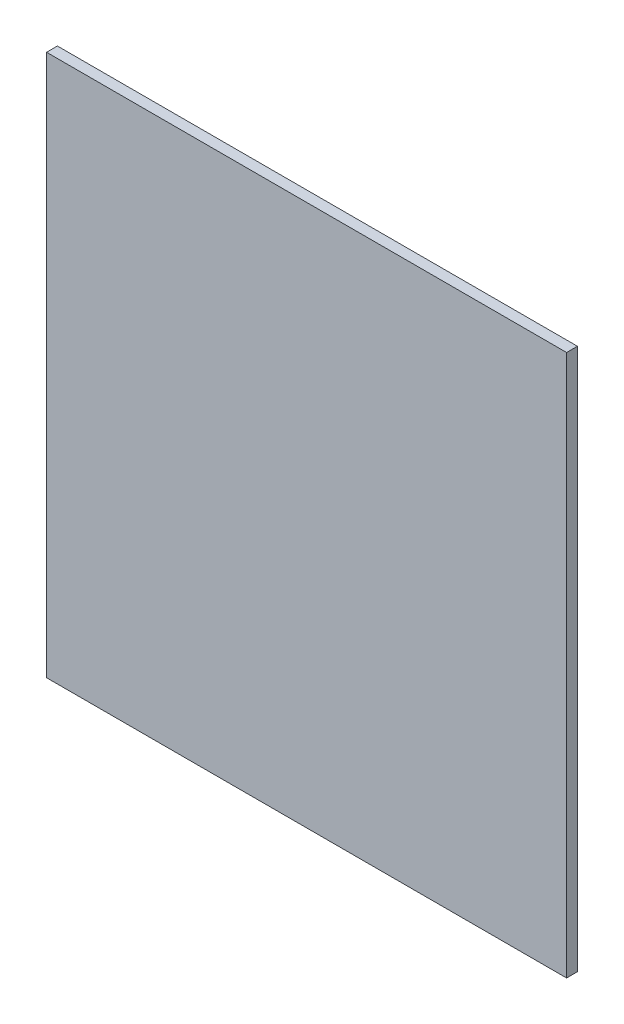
ISO-10303-21;
HEADER;
FILE_DESCRIPTION(('STEP AP214'),'2;1');
FILE_NAME('part.step','',(''),(''),'','','');
FILE_SCHEMA(('AUTOMOTIVE_DESIGN { 1 0 10303 214 1 1 1 1 }'));
ENDSEC;
DATA;
#1=APPLICATION_CONTEXT('core data for automotive mechanical design processes');
#2=APPLICATION_PROTOCOL_DEFINITION('international standard','automotive_design',2000,#1);
#3=PRODUCT_CONTEXT('',#1,'mechanical');
#4=PRODUCT('Part','Part','',(#3));
#5=PRODUCT_RELATED_PRODUCT_CATEGORY('part','',(#4));
#6=PRODUCT_DEFINITION_FORMATION('','',#4);
#7=PRODUCT_DEFINITION_CONTEXT('part definition',#1,'design');
#8=PRODUCT_DEFINITION('design','',#6,#7);
#9=PRODUCT_DEFINITION_SHAPE('','',#8);
#10=(LENGTH_UNIT() NAMED_UNIT(*) SI_UNIT(.MILLI.,.METRE.));
#11=(NAMED_UNIT(*) PLANE_ANGLE_UNIT() SI_UNIT($,.RADIAN.));
#12=(NAMED_UNIT(*) SI_UNIT($,.STERADIAN.) SOLID_ANGLE_UNIT());
#13=UNCERTAINTY_MEASURE_WITH_UNIT(LENGTH_MEASURE(1.E-05),#10,'distance_accuracy_value','');
#14=(GEOMETRIC_REPRESENTATION_CONTEXT(3) GLOBAL_UNCERTAINTY_ASSIGNED_CONTEXT((#13)) GLOBAL_UNIT_ASSIGNED_CONTEXT((#10,
#11,#12)) REPRESENTATION_CONTEXT('',''));
#15=CARTESIAN_POINT('',(0.,0.,0.));
#16=DIRECTION('',(0.,0.,1.));
#17=DIRECTION('',(1.,0.,0.));
#18=AXIS2_PLACEMENT_3D('',#15,#16,#17);
#19=CARTESIAN_POINT('',(304.8,-158.75,-158.75));
#20=DIRECTION('',(0.,1.,0.));
#21=DIRECTION('',(0.,0.,1.));
#22=AXIS2_PLACEMENT_3D('',#19,#20,#21);
#23=PLANE('',#22);
#24=DIRECTION('',(0.,0.,-1.));
#25=VECTOR('',#24,1.);
#26=CARTESIAN_POINT('',(0.,-158.75,-158.75));
#27=LINE('',#26,#25);
#28=CARTESIAN_POINT('',(0.,-158.75,-152.4));
#29=VERTEX_POINT('',#28);
#30=CARTESIAN_POINT('',(0.,-158.75,-158.75));
#31=VERTEX_POINT('',#30);
#32=EDGE_CURVE('E117',#29,#31,#27,.T.);
#33=ORIENTED_EDGE('',*,*,#32,.T.);
#34=DIRECTION('',(-1.,0.,0.));
#35=VECTOR('',#34,1.);
#36=CARTESIAN_POINT('',(304.8,-158.75,-158.75));
#37=LINE('',#36,#35);
#38=CARTESIAN_POINT('',(304.8,-158.75,-158.75));
#39=VERTEX_POINT('',#38);
#40=EDGE_CURVE('E11',#39,#31,#37,.T.);
#41=ORIENTED_EDGE('',*,*,#40,.F.);
#42=DIRECTION('',(0.,0.,-1.));
#43=VECTOR('',#42,1.);
#44=CARTESIAN_POINT('',(304.8,-158.75,-158.75));
#45=LINE('',#44,#43);
#46=CARTESIAN_POINT('',(304.8,-158.75,-152.4));
#47=VERTEX_POINT('',#46);
#48=EDGE_CURVE('E98',#47,#39,#45,.T.);
#49=ORIENTED_EDGE('',*,*,#48,.F.);
#50=DIRECTION('',(-1.,0.,0.));
#51=VECTOR('',#50,1.);
#52=CARTESIAN_POINT('',(304.8,-158.75,-152.4));
#53=LINE('',#52,#51);
#54=EDGE_CURVE('E115',#47,#29,#53,.T.);
#55=ORIENTED_EDGE('',*,*,#54,.T.);
#56=EDGE_LOOP('',(#33,#41,#49,#55));
#57=FACE_BOUND('',#56,.T.);
#58=ADVANCED_FACE('F50',(#57),#23,.F.);
#59=CARTESIAN_POINT('',(304.8,-158.75,-158.75));
#60=DIRECTION('',(0.,0.,1.));
#61=DIRECTION('',(1.,0.,0.));
#62=AXIS2_PLACEMENT_3D('',#59,#60,#61);
#63=PLANE('',#62);
#64=DIRECTION('',(0.,1.,0.));
#65=VECTOR('',#64,1.);
#66=CARTESIAN_POINT('',(0.,-158.75,-158.75));
#67=LINE('',#66,#65);
#68=CARTESIAN_POINT('',(0.,158.75,-158.75));
#69=VERTEX_POINT('',#68);
#70=EDGE_CURVE('E101',#31,#69,#67,.T.);
#71=ORIENTED_EDGE('',*,*,#70,.T.);
#72=DIRECTION('',(-1.,0.,0.));
#73=VECTOR('',#72,1.);
#74=CARTESIAN_POINT('',(304.8,158.75,-158.75));
#75=LINE('',#74,#73);
#76=CARTESIAN_POINT('',(304.8,158.75,-158.75));
#77=VERTEX_POINT('',#76);
#78=EDGE_CURVE('E57',#77,#69,#75,.T.);
#79=ORIENTED_EDGE('',*,*,#78,.F.);
#80=DIRECTION('',(0.,1.,0.));
#81=VECTOR('',#80,1.);
#82=CARTESIAN_POINT('',(304.8,-158.75,-158.75));
#83=LINE('',#82,#81);
#84=EDGE_CURVE('E92',#39,#77,#83,.T.);
#85=ORIENTED_EDGE('',*,*,#84,.F.);
#86=ORIENTED_EDGE('',*,*,#40,.T.);
#87=EDGE_LOOP('',(#71,#79,#85,#86));
#88=FACE_BOUND('',#87,.T.);
#89=ADVANCED_FACE('F104',(#88),#63,.F.);
#90=CARTESIAN_POINT('',(304.8,158.75,-158.75));
#91=DIRECTION('',(0.,-1.,0.));
#92=DIRECTION('',(0.,0.,-1.));
#93=AXIS2_PLACEMENT_3D('',#90,#91,#92);
#94=PLANE('',#93);
#95=DIRECTION('',(0.,0.,1.));
#96=VECTOR('',#95,1.);
#97=CARTESIAN_POINT('',(0.,158.75,-158.75));
#98=LINE('',#97,#96);
#99=CARTESIAN_POINT('',(0.,158.75,-152.4));
#100=VERTEX_POINT('',#99);
#101=EDGE_CURVE('E83',#69,#100,#98,.T.);
#102=ORIENTED_EDGE('',*,*,#101,.T.);
#103=DIRECTION('',(-1.,0.,0.));
#104=VECTOR('',#103,1.);
#105=CARTESIAN_POINT('',(304.8,158.75,-152.4));
#106=LINE('',#105,#104);
#107=CARTESIAN_POINT('',(304.8,158.75,-152.4));
#108=VERTEX_POINT('',#107);
#109=EDGE_CURVE('E108',#108,#100,#106,.T.);
#110=ORIENTED_EDGE('',*,*,#109,.F.);
#111=DIRECTION('',(0.,0.,1.));
#112=VECTOR('',#111,1.);
#113=CARTESIAN_POINT('',(304.8,158.75,-158.75));
#114=LINE('',#113,#112);
#115=EDGE_CURVE('E100',#77,#108,#114,.T.);
#116=ORIENTED_EDGE('',*,*,#115,.F.);
#117=ORIENTED_EDGE('',*,*,#78,.T.);
#118=EDGE_LOOP('',(#102,#110,#116,#117));
#119=FACE_BOUND('',#118,.T.);
#120=ADVANCED_FACE('F110',(#119),#94,.F.);
#121=CARTESIAN_POINT('',(304.8,-158.75,-152.4));
#122=DIRECTION('',(0.,0.,-1.));
#123=DIRECTION('',(-1.,0.,0.));
#124=AXIS2_PLACEMENT_3D('',#121,#122,#123);
#125=PLANE('',#124);
#126=DIRECTION('',(0.,-1.,0.));
#127=VECTOR('',#126,1.);
#128=CARTESIAN_POINT('',(0.,-158.75,-152.4));
#129=LINE('',#128,#127);
#130=EDGE_CURVE('E90',#100,#29,#129,.T.);
#131=ORIENTED_EDGE('',*,*,#130,.T.);
#132=ORIENTED_EDGE('',*,*,#54,.F.);
#133=DIRECTION('',(0.,-1.,0.));
#134=VECTOR('',#133,1.);
#135=CARTESIAN_POINT('',(304.8,-158.75,-152.4));
#136=LINE('',#135,#134);
#137=EDGE_CURVE('E62',#108,#47,#136,.T.);
#138=ORIENTED_EDGE('',*,*,#137,.F.);
#139=ORIENTED_EDGE('',*,*,#109,.T.);
#140=EDGE_LOOP('',(#131,#132,#138,#139));
#141=FACE_BOUND('',#140,.T.);
#142=ADVANCED_FACE('F127',(#141),#125,.F.);
#143=CARTESIAN_POINT('',(304.8,0.,0.));
#144=DIRECTION('',(-1.,0.,0.));
#145=DIRECTION('',(0.,0.,1.));
#146=AXIS2_PLACEMENT_3D('',#143,#144,#145);
#147=PLANE('',#146);
#148=ORIENTED_EDGE('',*,*,#48,.T.);
#149=ORIENTED_EDGE('',*,*,#84,.T.);
#150=ORIENTED_EDGE('',*,*,#115,.T.);
#151=ORIENTED_EDGE('',*,*,#137,.T.);
#152=EDGE_LOOP('',(#148,#149,#150,#151));
#153=FACE_BOUND('',#152,.T.);
#154=ADVANCED_FACE('F94',(#153),#147,.F.);
#155=CARTESIAN_POINT('',(0.,0.,0.));
#156=DIRECTION('',(-1.,0.,0.));
#157=DIRECTION('',(0.,0.,1.));
#158=AXIS2_PLACEMENT_3D('',#155,#156,#157);
#159=PLANE('',#158);
#160=ORIENTED_EDGE('',*,*,#32,.F.);
#161=ORIENTED_EDGE('',*,*,#130,.F.);
#162=ORIENTED_EDGE('',*,*,#101,.F.);
#163=ORIENTED_EDGE('',*,*,#70,.F.);
#164=EDGE_LOOP('',(#160,#161,#162,#163));
#165=FACE_BOUND('',#164,.T.);
#166=ADVANCED_FACE('F133',(#165),#159,.T.);
#167=CLOSED_SHELL('',(#58,#89,#120,#142,#154,#166));
#168=MANIFOLD_SOLID_BREP('B2',#167);
#169=ADVANCED_BREP_SHAPE_REPRESENTATION('',(#18,#168),#14);
#170=SHAPE_DEFINITION_REPRESENTATION(#9,#169);
ENDSEC;
END-ISO-10303-21;
